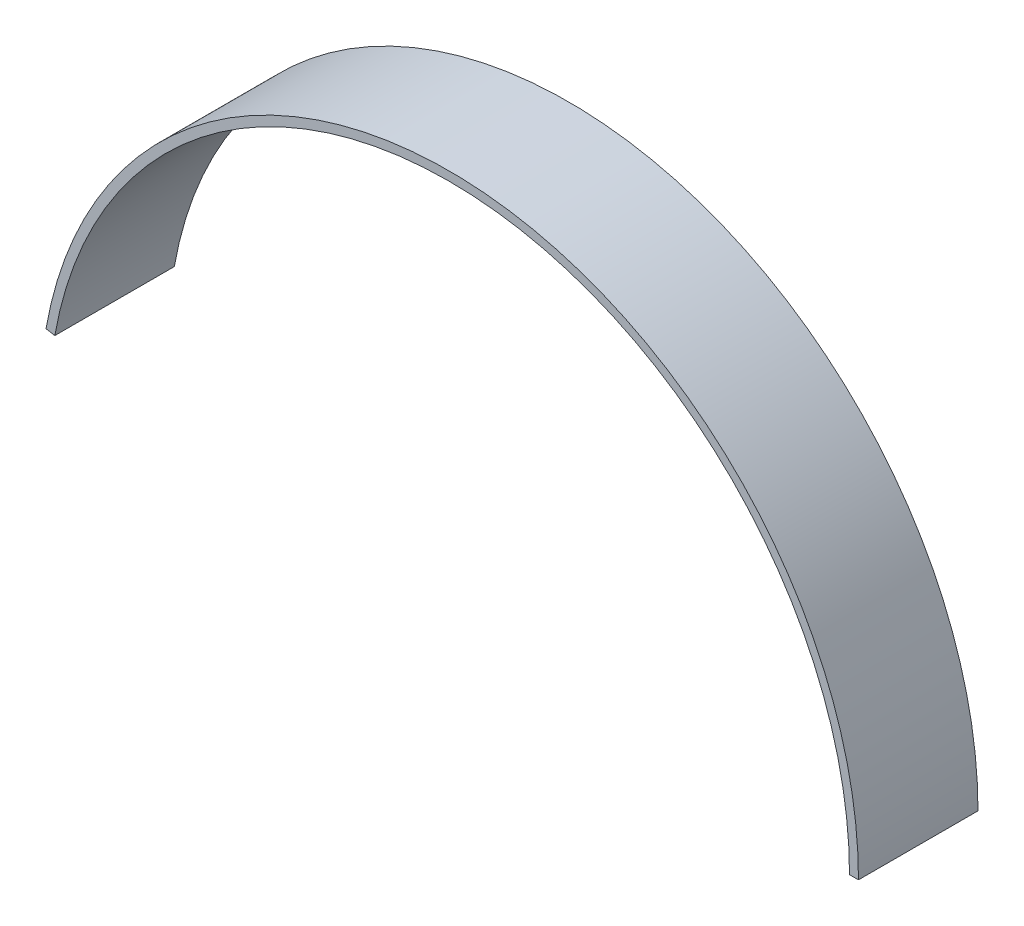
ISO-10303-21;
HEADER;
FILE_DESCRIPTION(('STEP AP214'),'2;1');
FILE_NAME('part.step','',(''),(''),'','','');
FILE_SCHEMA(('AUTOMOTIVE_DESIGN { 1 0 10303 214 1 1 1 1 }'));
ENDSEC;
DATA;
#1=APPLICATION_CONTEXT('core data for automotive mechanical design processes');
#2=APPLICATION_PROTOCOL_DEFINITION('international standard','automotive_design',2000,#1);
#3=PRODUCT_CONTEXT('',#1,'mechanical');
#4=PRODUCT('Part','Part','',(#3));
#5=PRODUCT_RELATED_PRODUCT_CATEGORY('part','',(#4));
#6=PRODUCT_DEFINITION_FORMATION('','',#4);
#7=PRODUCT_DEFINITION_CONTEXT('part definition',#1,'design');
#8=PRODUCT_DEFINITION('design','',#6,#7);
#9=PRODUCT_DEFINITION_SHAPE('','',#8);
#10=(LENGTH_UNIT() NAMED_UNIT(*) SI_UNIT(.MILLI.,.METRE.));
#11=(NAMED_UNIT(*) PLANE_ANGLE_UNIT() SI_UNIT($,.RADIAN.));
#12=(NAMED_UNIT(*) SI_UNIT($,.STERADIAN.) SOLID_ANGLE_UNIT());
#13=UNCERTAINTY_MEASURE_WITH_UNIT(LENGTH_MEASURE(1.E-05),#10,'distance_accuracy_value','');
#14=(GEOMETRIC_REPRESENTATION_CONTEXT(3) GLOBAL_UNCERTAINTY_ASSIGNED_CONTEXT((#13)) GLOBAL_UNIT_ASSIGNED_CONTEXT((#10,
#11,#12)) REPRESENTATION_CONTEXT('',''));
#15=CARTESIAN_POINT('',(0.,0.,0.));
#16=DIRECTION('',(0.,0.,1.));
#17=DIRECTION('',(1.,0.,0.));
#18=AXIS2_PLACEMENT_3D('',#15,#16,#17);
#19=CARTESIAN_POINT('',(7.225691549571,82.590032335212,40.));
#20=DIRECTION('',(0.,0.,1.));
#21=DIRECTION('',(1.,0.,0.));
#22=AXIS2_PLACEMENT_3D('',#19,#20,#21);
#23=PLANE('',#22);
#24=CARTESIAN_POINT('',(0.,0.,40.));
#25=DIRECTION('',(0.,0.,1.));
#26=DIRECTION('',(1.,0.,0.));
#27=AXIS2_PLACEMENT_3D('',#24,#25,#26);
#28=CIRCLE('',#27,137.);
#29=CARTESIAN_POINT('',(137.,0.,40.));
#30=VERTEX_POINT('',#29);
#31=CARTESIAN_POINT('',(-134.9186621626,23.789800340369,40.));
#32=VERTEX_POINT('',#31);
#33=EDGE_CURVE('E81',#30,#32,#28,.T.);
#34=ORIENTED_EDGE('',*,*,#33,.T.);
#35=DIRECTION('',(0.98480775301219,-0.173648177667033,0.));
#36=VECTOR('',#35,1.);
#37=CARTESIAN_POINT('',(-134.9186621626,23.789800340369,40.));
#38=LINE('',#37,#36);
#39=CARTESIAN_POINT('',(-131.9642389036,23.268855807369,40.));
#40=VERTEX_POINT('',#39);
#41=EDGE_CURVE('E107',#32,#40,#38,.T.);
#42=ORIENTED_EDGE('',*,*,#41,.T.);
#43=CARTESIAN_POINT('',(0.,0.,40.));
#44=DIRECTION('',(0.,0.,1.));
#45=DIRECTION('',(1.,0.,0.));
#46=AXIS2_PLACEMENT_3D('',#43,#44,#45);
#47=CIRCLE('',#46,134.);
#48=CARTESIAN_POINT('',(134.,0.,40.));
#49=VERTEX_POINT('',#48);
#50=EDGE_CURVE('E96',#49,#40,#47,.T.);
#51=ORIENTED_EDGE('',*,*,#50,.F.);
#52=DIRECTION('',(1.,0.,0.));
#53=VECTOR('',#52,1.);
#54=CARTESIAN_POINT('',(134.,0.,40.));
#55=LINE('',#54,#53);
#56=EDGE_CURVE('E10',#49,#30,#55,.T.);
#57=ORIENTED_EDGE('',*,*,#56,.T.);
#58=EDGE_LOOP('',(#34,#42,#51,#57));
#59=FACE_BOUND('',#58,.T.);
#60=ADVANCED_FACE('F16',(#59),#23,.T.);
#61=CARTESIAN_POINT('',(7.225691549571,82.590032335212,0.));
#62=DIRECTION('',(0.,0.,1.));
#63=DIRECTION('',(1.,0.,0.));
#64=AXIS2_PLACEMENT_3D('',#61,#62,#63);
#65=PLANE('',#64);
#66=DIRECTION('',(1.,0.,0.));
#67=VECTOR('',#66,1.);
#68=CARTESIAN_POINT('',(134.,0.,0.));
#69=LINE('',#68,#67);
#70=CARTESIAN_POINT('',(134.,0.,0.));
#71=VERTEX_POINT('',#70);
#72=CARTESIAN_POINT('',(137.,0.,0.));
#73=VERTEX_POINT('',#72);
#74=EDGE_CURVE('E25',#71,#73,#69,.T.);
#75=ORIENTED_EDGE('',*,*,#74,.F.);
#76=CARTESIAN_POINT('',(0.,0.,0.));
#77=DIRECTION('',(0.,0.,1.));
#78=DIRECTION('',(1.,0.,0.));
#79=AXIS2_PLACEMENT_3D('',#76,#77,#78);
#80=CIRCLE('',#79,134.);
#81=CARTESIAN_POINT('',(-131.9642389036,23.268855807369,0.));
#82=VERTEX_POINT('',#81);
#83=EDGE_CURVE('E74',#71,#82,#80,.T.);
#84=ORIENTED_EDGE('',*,*,#83,.T.);
#85=DIRECTION('',(0.98480775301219,-0.173648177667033,0.));
#86=VECTOR('',#85,1.);
#87=CARTESIAN_POINT('',(-134.9186621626,23.789800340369,0.));
#88=LINE('',#87,#86);
#89=CARTESIAN_POINT('',(-134.9186621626,23.789800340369,0.));
#90=VERTEX_POINT('',#89);
#91=EDGE_CURVE('E83',#90,#82,#88,.T.);
#92=ORIENTED_EDGE('',*,*,#91,.F.);
#93=CARTESIAN_POINT('',(0.,0.,0.));
#94=DIRECTION('',(0.,0.,1.));
#95=DIRECTION('',(1.,0.,0.));
#96=AXIS2_PLACEMENT_3D('',#93,#94,#95);
#97=CIRCLE('',#96,137.);
#98=EDGE_CURVE('E79',#73,#90,#97,.T.);
#99=ORIENTED_EDGE('',*,*,#98,.F.);
#100=EDGE_LOOP('',(#75,#84,#92,#99));
#101=FACE_BOUND('',#100,.T.);
#102=ADVANCED_FACE('F18',(#101),#65,.F.);
#103=CARTESIAN_POINT('',(134.,0.,0.));
#104=DIRECTION('',(0.,1.,0.));
#105=DIRECTION('',(1.,0.,0.));
#106=AXIS2_PLACEMENT_3D('',#103,#104,#105);
#107=PLANE('',#106);
#108=ORIENTED_EDGE('',*,*,#74,.T.);
#109=DIRECTION('',(0.,0.,1.));
#110=VECTOR('',#109,1.);
#111=CARTESIAN_POINT('',(137.,0.,0.));
#112=LINE('',#111,#110);
#113=EDGE_CURVE('E69',#73,#30,#112,.T.);
#114=ORIENTED_EDGE('',*,*,#113,.T.);
#115=ORIENTED_EDGE('',*,*,#56,.F.);
#116=DIRECTION('',(0.,0.,1.));
#117=VECTOR('',#116,1.);
#118=CARTESIAN_POINT('',(134.,0.,0.));
#119=LINE('',#118,#117);
#120=EDGE_CURVE('E72',#71,#49,#119,.T.);
#121=ORIENTED_EDGE('',*,*,#120,.F.);
#122=EDGE_LOOP('',(#108,#114,#115,#121));
#123=FACE_BOUND('',#122,.T.);
#124=ADVANCED_FACE('F68',(#123),#107,.F.);
#125=CARTESIAN_POINT('',(0.,0.,0.));
#126=DIRECTION('',(0.,0.,-1.));
#127=DIRECTION('',(1.,0.,0.));
#128=AXIS2_PLACEMENT_3D('',#125,#126,#127);
#129=CYLINDRICAL_SURFACE('',#128,134.);
#130=ORIENTED_EDGE('',*,*,#120,.T.);
#131=ORIENTED_EDGE('',*,*,#50,.T.);
#132=DIRECTION('',(0.,0.,1.));
#133=VECTOR('',#132,1.);
#134=CARTESIAN_POINT('',(-131.9642389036,23.268855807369,0.));
#135=LINE('',#134,#133);
#136=EDGE_CURVE('E101',#82,#40,#135,.T.);
#137=ORIENTED_EDGE('',*,*,#136,.F.);
#138=ORIENTED_EDGE('',*,*,#83,.F.);
#139=EDGE_LOOP('',(#130,#131,#137,#138));
#140=FACE_BOUND('',#139,.T.);
#141=ADVANCED_FACE('F114',(#140),#129,.F.);
#142=CARTESIAN_POINT('',(-134.9186621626,23.789800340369,0.));
#143=DIRECTION('',(0.173648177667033,0.98480775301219,0.));
#144=DIRECTION('',(0.,0.,-1.));
#145=AXIS2_PLACEMENT_3D('',#142,#143,#144);
#146=PLANE('',#145);
#147=ORIENTED_EDGE('',*,*,#91,.T.);
#148=ORIENTED_EDGE('',*,*,#136,.T.);
#149=ORIENTED_EDGE('',*,*,#41,.F.);
#150=DIRECTION('',(0.,0.,1.));
#151=VECTOR('',#150,1.);
#152=CARTESIAN_POINT('',(-134.9186621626,23.789800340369,0.));
#153=LINE('',#152,#151);
#154=EDGE_CURVE('E88',#90,#32,#153,.T.);
#155=ORIENTED_EDGE('',*,*,#154,.F.);
#156=EDGE_LOOP('',(#147,#148,#149,#155));
#157=FACE_BOUND('',#156,.T.);
#158=ADVANCED_FACE('F117',(#157),#146,.F.);
#159=CARTESIAN_POINT('',(0.,0.,0.));
#160=DIRECTION('',(0.,0.,-1.));
#161=DIRECTION('',(1.,0.,0.));
#162=AXIS2_PLACEMENT_3D('',#159,#160,#161);
#163=CYLINDRICAL_SURFACE('',#162,137.);
#164=ORIENTED_EDGE('',*,*,#98,.T.);
#165=ORIENTED_EDGE('',*,*,#154,.T.);
#166=ORIENTED_EDGE('',*,*,#33,.F.);
#167=ORIENTED_EDGE('',*,*,#113,.F.);
#168=EDGE_LOOP('',(#164,#165,#166,#167));
#169=FACE_BOUND('',#168,.T.);
#170=ADVANCED_FACE('F77',(#169),#163,.T.);
#171=CLOSED_SHELL('',(#60,#102,#124,#141,#158,#170));
#172=MANIFOLD_SOLID_BREP('B1',#171);
#173=ADVANCED_BREP_SHAPE_REPRESENTATION('',(#18,#172),#14);
#174=SHAPE_DEFINITION_REPRESENTATION(#9,#173);
ENDSEC;
END-ISO-10303-21;
